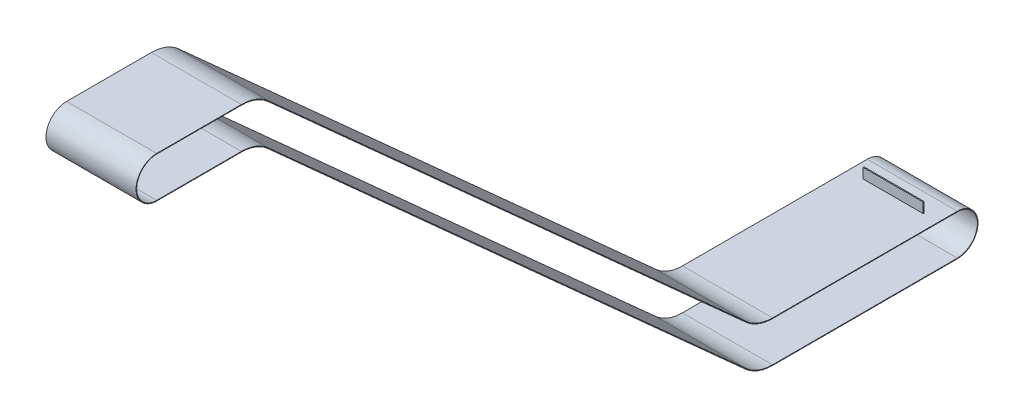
from build123d import *

# Parameters (mm, degrees)
EXTRUDE_THIN1_DEPTH = 450
SKETCH2_W           = 600
SKETCH2_H           = 10
BOSS_EXTRUDE1_DEPTH = 100


with BuildPart() as part:
    # Sketch1 → Extrude-Thin1 (new, symmetric)
    with BuildSketch(Plane(origin=(0, 0, 0), x_dir=(0, 0, -1), z_dir=(1, 0, 0))):
        with BuildLine():
            Line((-2889.922297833, 1742.857893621), (1881.894721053, -2551.777423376))
            ThreePointArc((1881.894721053, -2551.777423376), (2008.039312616, -2629.049887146), (2153.494402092, -2656))
            Line((2153.494402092, -2656), (4000, -2656))
            ThreePointArc((4000, -2656), (4206, -2450), (4000, -2244))
            Line((4000, -2244), (2153.494402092, -2244))
            ThreePointArc((2153.494402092, -2244), (2012.338477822, -2217.846442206), (1889.922297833, -2142.857893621))
            Line((1889.922297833, -2142.857893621), (-2881.894721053, 2151.777423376))
            ThreePointArc((-2881.894721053, 2151.777423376), (-3008.039312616, 2229.049887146), (-3153.494402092, 2256))
            Line((-3153.494402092, 2256), (-4000, 2256))
            ThreePointArc((-4000, 2256), (-4206, 2050), (-4000, 1844))
            Line((-4000, 1844), (-3153.494402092, 1844))
            ThreePointArc((-3153.494402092, 1844), (-3012.338477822, 1817.846442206), (-2889.922297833, 1742.857893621))
        make_face()
        with BuildLine():
            Line((-2885.908509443, 1747.317658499), (1885.908509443, -2547.317658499))
            ThreePointArc((1885.908509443, -2547.317658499), (2010.188895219, -2623.448164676), (2153.494402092, -2650))
            Line((2153.494402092, -2650), (4000, -2650))
            ThreePointArc((4000, -2650), (4200, -2450), (4000, -2250))
            Line((4000, -2250), (2153.494402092, -2250))
            ThreePointArc((2153.494402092, -2250), (2010.188895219, -2223.448164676), (1885.908509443, -2147.317658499))
            Line((1885.908509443, -2147.317658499), (-2885.908509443, 2147.317658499))
            ThreePointArc((-2885.908509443, 2147.317658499), (-3010.188895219, 2223.448164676), (-3153.494402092, 2250))
            Line((-3153.494402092, 2250), (-4000, 2250))
            ThreePointArc((-4000, 2250), (-4200, 2050), (-4000, 1850))
            Line((-4000, 1850), (-3153.494402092, 1850))
            ThreePointArc((-3153.494402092, 1850), (-3010.188895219, 1823.448164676), (-2885.908509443, 1747.317658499))
        make_face(mode=Mode.SUBTRACT)
    extrude(amount=EXTRUDE_THIN1_DEPTH, both=True)

    # Sketch2 → Boss-Extrude1 (add)
    with BuildSketch(Plane(origin=(0, -2244, 0), x_dir=(1, 0, 0), z_dir=(0, 1, 0))):
        with Locations((0, 3813.004582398)):
            Rectangle(SKETCH2_W, SKETCH2_H)
    extrude(amount=BOSS_EXTRUDE1_DEPTH)


solid = part.part
